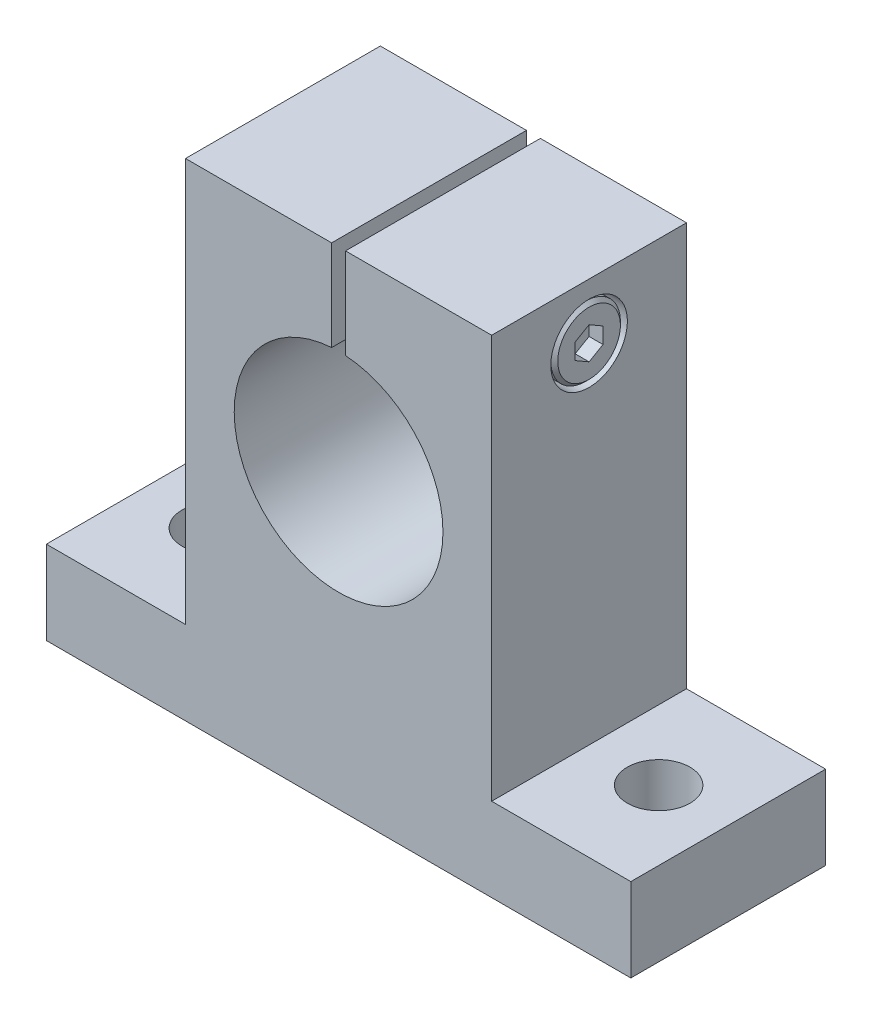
ISO-10303-21;
HEADER;
FILE_DESCRIPTION(('STEP AP214'),'2;1');
FILE_NAME('part.step','',(''),(''),'','','');
FILE_SCHEMA(('AUTOMOTIVE_DESIGN { 1 0 10303 214 1 1 1 1 }'));
ENDSEC;
DATA;
#1=APPLICATION_CONTEXT('core data for automotive mechanical design processes');
#2=APPLICATION_PROTOCOL_DEFINITION('international standard','automotive_design',2000,#1);
#3=PRODUCT_CONTEXT('',#1,'mechanical');
#4=PRODUCT('Part','Part','',(#3));
#5=PRODUCT_RELATED_PRODUCT_CATEGORY('part','',(#4));
#6=PRODUCT_DEFINITION_FORMATION('','',#4);
#7=PRODUCT_DEFINITION_CONTEXT('part definition',#1,'design');
#8=PRODUCT_DEFINITION('design','',#6,#7);
#9=PRODUCT_DEFINITION_SHAPE('','',#8);
#10=(LENGTH_UNIT() NAMED_UNIT(*) SI_UNIT(.MILLI.,.METRE.));
#11=(NAMED_UNIT(*) PLANE_ANGLE_UNIT() SI_UNIT($,.RADIAN.));
#12=(NAMED_UNIT(*) SI_UNIT($,.STERADIAN.) SOLID_ANGLE_UNIT());
#13=UNCERTAINTY_MEASURE_WITH_UNIT(LENGTH_MEASURE(1.E-05),#10,'distance_accuracy_value','');
#14=(GEOMETRIC_REPRESENTATION_CONTEXT(3) GLOBAL_UNCERTAINTY_ASSIGNED_CONTEXT((#13)) GLOBAL_UNIT_ASSIGNED_CONTEXT((#10,
#11,#12)) REPRESENTATION_CONTEXT('',''));
#15=CARTESIAN_POINT('',(0.,0.,0.));
#16=DIRECTION('',(0.,0.,1.));
#17=DIRECTION('',(1.,0.,0.));
#18=AXIS2_PLACEMENT_3D('',#15,#16,#17);
#19=CARTESIAN_POINT('',(0.,0.,-28.));
#20=DIRECTION('',(0.,0.,1.));
#21=DIRECTION('',(1.,0.,0.));
#22=AXIS2_PLACEMENT_3D('',#19,#20,#21);
#23=PLANE('',#22);
#24=DIRECTION('',(0.,1.,0.));
#25=VECTOR('',#24,1.);
#26=CARTESIAN_POINT('',(1.,0.,-28.));
#27=LINE('',#26,#25);
#28=CARTESIAN_POINT('',(1.,14.9666295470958,-28.));
#29=VERTEX_POINT('',#28);
#30=CARTESIAN_POINT('',(1.,28.,-28.));
#31=VERTEX_POINT('',#30);
#32=EDGE_CURVE('E237',#29,#31,#27,.T.);
#33=ORIENTED_EDGE('',*,*,#32,.T.);
#34=DIRECTION('',(-1.,0.,0.));
#35=VECTOR('',#34,1.);
#36=CARTESIAN_POINT('',(22.,28.,-28.));
#37=LINE('',#36,#35);
#38=CARTESIAN_POINT('',(22.,28.,-28.));
#39=VERTEX_POINT('',#38);
#40=EDGE_CURVE('E280',#39,#31,#37,.T.);
#41=ORIENTED_EDGE('',*,*,#40,.F.);
#42=DIRECTION('',(0.,1.,0.));
#43=VECTOR('',#42,1.);
#44=CARTESIAN_POINT('',(22.,-30.,-28.));
#45=LINE('',#44,#43);
#46=CARTESIAN_POINT('',(22.,-30.,-28.));
#47=VERTEX_POINT('',#46);
#48=EDGE_CURVE('E422',#47,#39,#45,.T.);
#49=ORIENTED_EDGE('',*,*,#48,.F.);
#50=DIRECTION('',(-1.,0.,0.));
#51=VECTOR('',#50,1.);
#52=CARTESIAN_POINT('',(42.,-30.,-28.));
#53=LINE('',#52,#51);
#54=CARTESIAN_POINT('',(42.,-30.,-28.));
#55=VERTEX_POINT('',#54);
#56=EDGE_CURVE('E481',#55,#47,#53,.T.);
#57=ORIENTED_EDGE('',*,*,#56,.F.);
#58=DIRECTION('',(0.,1.,0.));
#59=VECTOR('',#58,1.);
#60=CARTESIAN_POINT('',(42.,-42.,-28.));
#61=LINE('',#60,#59);
#62=CARTESIAN_POINT('',(42.,-42.,-28.));
#63=VERTEX_POINT('',#62);
#64=EDGE_CURVE('E473',#63,#55,#61,.T.);
#65=ORIENTED_EDGE('',*,*,#64,.F.);
#66=DIRECTION('',(1.,0.,0.));
#67=VECTOR('',#66,1.);
#68=CARTESIAN_POINT('',(-42.,-42.,-28.));
#69=LINE('',#68,#67);
#70=CARTESIAN_POINT('',(-42.,-42.,-28.));
#71=VERTEX_POINT('',#70);
#72=EDGE_CURVE('E10',#71,#63,#69,.T.);
#73=ORIENTED_EDGE('',*,*,#72,.F.);
#74=DIRECTION('',(0.,-1.,0.));
#75=VECTOR('',#74,1.);
#76=CARTESIAN_POINT('',(-42.,-30.,-28.));
#77=LINE('',#76,#75);
#78=CARTESIAN_POINT('',(-42.,-30.,-28.));
#79=VERTEX_POINT('',#78);
#80=EDGE_CURVE('E43',#79,#71,#77,.T.);
#81=ORIENTED_EDGE('',*,*,#80,.F.);
#82=DIRECTION('',(-1.,0.,0.));
#83=VECTOR('',#82,1.);
#84=CARTESIAN_POINT('',(-22.,-30.,-28.));
#85=LINE('',#84,#83);
#86=CARTESIAN_POINT('',(-22.,-30.,-28.));
#87=VERTEX_POINT('',#86);
#88=EDGE_CURVE('E373',#87,#79,#85,.T.);
#89=ORIENTED_EDGE('',*,*,#88,.F.);
#90=DIRECTION('',(0.,-1.,0.));
#91=VECTOR('',#90,1.);
#92=CARTESIAN_POINT('',(-22.,28.,-28.));
#93=LINE('',#92,#91);
#94=CARTESIAN_POINT('',(-22.,28.,-28.));
#95=VERTEX_POINT('',#94);
#96=EDGE_CURVE('E283',#95,#87,#93,.T.);
#97=ORIENTED_EDGE('',*,*,#96,.F.);
#98=DIRECTION('',(-1.,0.,0.));
#99=VECTOR('',#98,1.);
#100=CARTESIAN_POINT('',(22.,28.,-28.));
#101=LINE('',#100,#99);
#102=CARTESIAN_POINT('',(-1.,28.,-28.));
#103=VERTEX_POINT('',#102);
#104=EDGE_CURVE('E231',#103,#95,#101,.T.);
#105=ORIENTED_EDGE('',*,*,#104,.F.);
#106=DIRECTION('',(0.,-1.,0.));
#107=VECTOR('',#106,1.);
#108=CARTESIAN_POINT('',(-1.,14.,-28.));
#109=LINE('',#108,#107);
#110=CARTESIAN_POINT('',(-1.,14.9666295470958,-28.));
#111=VERTEX_POINT('',#110);
#112=EDGE_CURVE('E225',#103,#111,#109,.T.);
#113=ORIENTED_EDGE('',*,*,#112,.T.);
#114=CARTESIAN_POINT('',(0.,0.,-28.));
#115=DIRECTION('',(0.,0.,1.));
#116=DIRECTION('',(1.,0.,0.));
#117=AXIS2_PLACEMENT_3D('',#114,#115,#116);
#118=CIRCLE('',#117,15.);
#119=EDGE_CURVE('E229',#111,#29,#118,.T.);
#120=ORIENTED_EDGE('',*,*,#119,.T.);
#121=EDGE_LOOP('',(#33,#41,#49,#57,#65,#73,#81,#89,#97,#105,#113,#120));
#122=FACE_BOUND('',#121,.T.);
#123=ADVANCED_FACE('F16',(#122),#23,.F.);
#124=CARTESIAN_POINT('',(-42.,-42.,0.));
#125=DIRECTION('',(0.,-1.,0.));
#126=DIRECTION('',(0.,0.,-1.));
#127=AXIS2_PLACEMENT_3D('',#124,#125,#126);
#128=PLANE('',#127);
#129=CARTESIAN_POINT('',(32.,-42.,-14.));
#130=DIRECTION('',(0.,1.,0.));
#131=DIRECTION('',(0.,0.,-1.));
#132=AXIS2_PLACEMENT_3D('',#129,#130,#131);
#133=CIRCLE('',#132,4.5);
#134=CARTESIAN_POINT('',(32.,-42.,-9.5));
#135=VERTEX_POINT('',#134);
#136=EDGE_CURVE('E292',#135,#135,#133,.T.);
#137=ORIENTED_EDGE('',*,*,#136,.T.);
#138=EDGE_LOOP('',(#137));
#139=FACE_BOUND('',#138,.T.);
#140=CARTESIAN_POINT('',(-32.,-42.,-14.));
#141=DIRECTION('',(0.,1.,0.));
#142=DIRECTION('',(0.,0.,-1.));
#143=AXIS2_PLACEMENT_3D('',#140,#141,#142);
#144=CIRCLE('',#143,4.5);
#145=CARTESIAN_POINT('',(-32.,-42.,-9.5));
#146=VERTEX_POINT('',#145);
#147=EDGE_CURVE('E267',#146,#146,#144,.T.);
#148=ORIENTED_EDGE('',*,*,#147,.T.);
#149=EDGE_LOOP('',(#148));
#150=FACE_BOUND('',#149,.T.);
#151=ORIENTED_EDGE('',*,*,#72,.T.);
#152=DIRECTION('',(0.,0.,-1.));
#153=VECTOR('',#152,1.);
#154=CARTESIAN_POINT('',(42.,-42.,0.));
#155=LINE('',#154,#153);
#156=CARTESIAN_POINT('',(42.,-42.,0.));
#157=VERTEX_POINT('',#156);
#158=EDGE_CURVE('E477',#157,#63,#155,.T.);
#159=ORIENTED_EDGE('',*,*,#158,.F.);
#160=DIRECTION('',(1.,0.,0.));
#161=VECTOR('',#160,1.);
#162=CARTESIAN_POINT('',(-42.,-42.,0.));
#163=LINE('',#162,#161);
#164=CARTESIAN_POINT('',(-42.,-42.,0.));
#165=VERTEX_POINT('',#164);
#166=EDGE_CURVE('E353',#165,#157,#163,.T.);
#167=ORIENTED_EDGE('',*,*,#166,.F.);
#168=DIRECTION('',(0.,0.,-1.));
#169=VECTOR('',#168,1.);
#170=CARTESIAN_POINT('',(-42.,-42.,0.));
#171=LINE('',#170,#169);
#172=EDGE_CURVE('E25',#165,#71,#171,.T.);
#173=ORIENTED_EDGE('',*,*,#172,.T.);
#174=EDGE_LOOP('',(#151,#159,#167,#173));
#175=FACE_BOUND('',#174,.T.);
#176=ADVANCED_FACE('F513',(#139,#150,#175),#128,.T.);
#177=CARTESIAN_POINT('',(-42.,-30.,0.));
#178=DIRECTION('',(-1.,0.,0.));
#179=DIRECTION('',(0.,0.,1.));
#180=AXIS2_PLACEMENT_3D('',#177,#178,#179);
#181=PLANE('',#180);
#182=ORIENTED_EDGE('',*,*,#80,.T.);
#183=ORIENTED_EDGE('',*,*,#172,.F.);
#184=DIRECTION('',(0.,-1.,0.));
#185=VECTOR('',#184,1.);
#186=CARTESIAN_POINT('',(-42.,-30.,0.));
#187=LINE('',#186,#185);
#188=CARTESIAN_POINT('',(-42.,-30.,0.));
#189=VERTEX_POINT('',#188);
#190=EDGE_CURVE('E303',#189,#165,#187,.T.);
#191=ORIENTED_EDGE('',*,*,#190,.F.);
#192=DIRECTION('',(0.,0.,-1.));
#193=VECTOR('',#192,1.);
#194=CARTESIAN_POINT('',(-42.,-30.,0.));
#195=LINE('',#194,#193);
#196=EDGE_CURVE('E19',#189,#79,#195,.T.);
#197=ORIENTED_EDGE('',*,*,#196,.T.);
#198=EDGE_LOOP('',(#182,#183,#191,#197));
#199=FACE_BOUND('',#198,.T.);
#200=ADVANCED_FACE('F516',(#199),#181,.T.);
#201=CARTESIAN_POINT('',(-22.,-30.,0.));
#202=DIRECTION('',(0.,1.,0.));
#203=DIRECTION('',(1.,0.,0.));
#204=AXIS2_PLACEMENT_3D('',#201,#202,#203);
#205=PLANE('',#204);
#206=CARTESIAN_POINT('',(-32.,-30.,-14.));
#207=DIRECTION('',(0.,-1.,0.));
#208=DIRECTION('',(0.,0.,-1.));
#209=AXIS2_PLACEMENT_3D('',#206,#207,#208);
#210=CIRCLE('',#209,4.5);
#211=CARTESIAN_POINT('',(-32.,-30.,-9.5));
#212=VERTEX_POINT('',#211);
#213=EDGE_CURVE('E295',#212,#212,#210,.T.);
#214=ORIENTED_EDGE('',*,*,#213,.T.);
#215=EDGE_LOOP('',(#214));
#216=FACE_BOUND('',#215,.T.);
#217=ORIENTED_EDGE('',*,*,#88,.T.);
#218=ORIENTED_EDGE('',*,*,#196,.F.);
#219=DIRECTION('',(-1.,0.,0.));
#220=VECTOR('',#219,1.);
#221=CARTESIAN_POINT('',(-22.,-30.,0.));
#222=LINE('',#221,#220);
#223=CARTESIAN_POINT('',(-22.,-30.,0.));
#224=VERTEX_POINT('',#223);
#225=EDGE_CURVE('E299',#224,#189,#222,.T.);
#226=ORIENTED_EDGE('',*,*,#225,.F.);
#227=DIRECTION('',(0.,0.,-1.));
#228=VECTOR('',#227,1.);
#229=CARTESIAN_POINT('',(-22.,-30.,0.));
#230=LINE('',#229,#228);
#231=EDGE_CURVE('E377',#224,#87,#230,.T.);
#232=ORIENTED_EDGE('',*,*,#231,.T.);
#233=EDGE_LOOP('',(#217,#218,#226,#232));
#234=FACE_BOUND('',#233,.T.);
#235=ADVANCED_FACE('F520',(#216,#234),#205,.T.);
#236=CARTESIAN_POINT('',(-22.,28.,0.));
#237=DIRECTION('',(-1.,0.,0.));
#238=DIRECTION('',(0.,0.,1.));
#239=AXIS2_PLACEMENT_3D('',#236,#237,#238);
#240=PLANE('',#239);
#241=ORIENTED_EDGE('',*,*,#96,.T.);
#242=ORIENTED_EDGE('',*,*,#231,.F.);
#243=DIRECTION('',(0.,-1.,0.));
#244=VECTOR('',#243,1.);
#245=CARTESIAN_POINT('',(-22.,28.,0.));
#246=LINE('',#245,#244);
#247=CARTESIAN_POINT('',(-22.,28.,0.));
#248=VERTEX_POINT('',#247);
#249=EDGE_CURVE('E304',#248,#224,#246,.T.);
#250=ORIENTED_EDGE('',*,*,#249,.F.);
#251=DIRECTION('',(0.,0.,-1.));
#252=VECTOR('',#251,1.);
#253=CARTESIAN_POINT('',(-22.,28.,0.));
#254=LINE('',#253,#252);
#255=EDGE_CURVE('E469',#248,#95,#254,.T.);
#256=ORIENTED_EDGE('',*,*,#255,.T.);
#257=EDGE_LOOP('',(#241,#242,#250,#256));
#258=FACE_BOUND('',#257,.T.);
#259=ADVANCED_FACE('F523',(#258),#240,.T.);
#260=CARTESIAN_POINT('',(22.,28.,0.));
#261=DIRECTION('',(0.,1.,0.));
#262=DIRECTION('',(1.,0.,0.));
#263=AXIS2_PLACEMENT_3D('',#260,#261,#262);
#264=PLANE('',#263);
#265=DIRECTION('',(0.,0.,1.));
#266=VECTOR('',#265,1.);
#267=CARTESIAN_POINT('',(1.,28.,0.));
#268=LINE('',#267,#266);
#269=CARTESIAN_POINT('',(1.,28.,0.));
#270=VERTEX_POINT('',#269);
#271=EDGE_CURVE('E432',#31,#270,#268,.T.);
#272=ORIENTED_EDGE('',*,*,#271,.T.);
#273=DIRECTION('',(-1.,0.,0.));
#274=VECTOR('',#273,1.);
#275=CARTESIAN_POINT('',(22.,28.,0.));
#276=LINE('',#275,#274);
#277=CARTESIAN_POINT('',(22.,28.,0.));
#278=VERTEX_POINT('',#277);
#279=EDGE_CURVE('E464',#278,#270,#276,.T.);
#280=ORIENTED_EDGE('',*,*,#279,.F.);
#281=DIRECTION('',(0.,0.,-1.));
#282=VECTOR('',#281,1.);
#283=CARTESIAN_POINT('',(22.,28.,0.));
#284=LINE('',#283,#282);
#285=EDGE_CURVE('E284',#278,#39,#284,.T.);
#286=ORIENTED_EDGE('',*,*,#285,.T.);
#287=ORIENTED_EDGE('',*,*,#40,.T.);
#288=EDGE_LOOP('',(#272,#280,#286,#287));
#289=FACE_BOUND('',#288,.T.);
#290=ADVANCED_FACE('F493',(#289),#264,.T.);
#291=CARTESIAN_POINT('',(22.,-30.,0.));
#292=DIRECTION('',(1.,0.,0.));
#293=DIRECTION('',(0.,1.,0.));
#294=AXIS2_PLACEMENT_3D('',#291,#292,#293);
#295=PLANE('',#294);
#296=CARTESIAN_POINT('',(22.,20.,-14.));
#297=DIRECTION('',(-1.,0.,0.));
#298=DIRECTION('',(0.,0.,-1.));
#299=AXIS2_PLACEMENT_3D('',#296,#297,#298);
#300=CIRCLE('',#299,5.5);
#301=CARTESIAN_POINT('',(22.,20.,-8.5));
#302=VERTEX_POINT('',#301);
#303=EDGE_CURVE('E275',#302,#302,#300,.T.);
#304=ORIENTED_EDGE('',*,*,#303,.T.);
#305=EDGE_LOOP('',(#304));
#306=FACE_BOUND('',#305,.T.);
#307=ORIENTED_EDGE('',*,*,#48,.T.);
#308=ORIENTED_EDGE('',*,*,#285,.F.);
#309=DIRECTION('',(0.,1.,0.));
#310=VECTOR('',#309,1.);
#311=CARTESIAN_POINT('',(22.,-30.,0.));
#312=LINE('',#311,#310);
#313=CARTESIAN_POINT('',(22.,-30.,0.));
#314=VERTEX_POINT('',#313);
#315=EDGE_CURVE('E460',#314,#278,#312,.T.);
#316=ORIENTED_EDGE('',*,*,#315,.F.);
#317=DIRECTION('',(0.,0.,-1.));
#318=VECTOR('',#317,1.);
#319=CARTESIAN_POINT('',(22.,-30.,0.));
#320=LINE('',#319,#318);
#321=EDGE_CURVE('E426',#314,#47,#320,.T.);
#322=ORIENTED_EDGE('',*,*,#321,.T.);
#323=EDGE_LOOP('',(#307,#308,#316,#322));
#324=FACE_BOUND('',#323,.T.);
#325=ADVANCED_FACE('F496',(#306,#324),#295,.T.);
#326=CARTESIAN_POINT('',(42.,-30.,0.));
#327=DIRECTION('',(0.,1.,0.));
#328=DIRECTION('',(1.,0.,0.));
#329=AXIS2_PLACEMENT_3D('',#326,#327,#328);
#330=PLANE('',#329);
#331=CARTESIAN_POINT('',(32.,-30.,-14.));
#332=DIRECTION('',(0.,-1.,0.));
#333=DIRECTION('',(0.,0.,-1.));
#334=AXIS2_PLACEMENT_3D('',#331,#332,#333);
#335=CIRCLE('',#334,4.5);
#336=CARTESIAN_POINT('',(32.,-30.,-9.5));
#337=VERTEX_POINT('',#336);
#338=EDGE_CURVE('E268',#337,#337,#335,.T.);
#339=ORIENTED_EDGE('',*,*,#338,.T.);
#340=EDGE_LOOP('',(#339));
#341=FACE_BOUND('',#340,.T.);
#342=ORIENTED_EDGE('',*,*,#56,.T.);
#343=ORIENTED_EDGE('',*,*,#321,.F.);
#344=DIRECTION('',(-1.,0.,0.));
#345=VECTOR('',#344,1.);
#346=CARTESIAN_POINT('',(42.,-30.,0.));
#347=LINE('',#346,#345);
#348=CARTESIAN_POINT('',(42.,-30.,0.));
#349=VERTEX_POINT('',#348);
#350=EDGE_CURVE('E456',#349,#314,#347,.T.);
#351=ORIENTED_EDGE('',*,*,#350,.F.);
#352=DIRECTION('',(0.,0.,-1.));
#353=VECTOR('',#352,1.);
#354=CARTESIAN_POINT('',(42.,-30.,0.));
#355=LINE('',#354,#353);
#356=EDGE_CURVE('E261',#349,#55,#355,.T.);
#357=ORIENTED_EDGE('',*,*,#356,.T.);
#358=EDGE_LOOP('',(#342,#343,#351,#357));
#359=FACE_BOUND('',#358,.T.);
#360=ADVANCED_FACE('F507',(#341,#359),#330,.T.);
#361=CARTESIAN_POINT('',(42.,-42.,0.));
#362=DIRECTION('',(1.,0.,0.));
#363=DIRECTION('',(0.,1.,0.));
#364=AXIS2_PLACEMENT_3D('',#361,#362,#363);
#365=PLANE('',#364);
#366=ORIENTED_EDGE('',*,*,#64,.T.);
#367=ORIENTED_EDGE('',*,*,#356,.F.);
#368=DIRECTION('',(0.,1.,0.));
#369=VECTOR('',#368,1.);
#370=CARTESIAN_POINT('',(42.,-42.,0.));
#371=LINE('',#370,#369);
#372=EDGE_CURVE('E357',#157,#349,#371,.T.);
#373=ORIENTED_EDGE('',*,*,#372,.F.);
#374=ORIENTED_EDGE('',*,*,#158,.T.);
#375=EDGE_LOOP('',(#366,#367,#373,#374));
#376=FACE_BOUND('',#375,.T.);
#377=ADVANCED_FACE('F510',(#376),#365,.T.);
#378=CARTESIAN_POINT('',(22.,28.,0.));
#379=DIRECTION('',(0.,1.,0.));
#380=DIRECTION('',(1.,0.,0.));
#381=AXIS2_PLACEMENT_3D('',#378,#379,#380);
#382=PLANE('',#381);
#383=DIRECTION('',(0.,0.,-1.));
#384=VECTOR('',#383,1.);
#385=CARTESIAN_POINT('',(-1.,28.,0.));
#386=LINE('',#385,#384);
#387=CARTESIAN_POINT('',(-1.,28.,0.));
#388=VERTEX_POINT('',#387);
#389=EDGE_CURVE('E236',#388,#103,#386,.T.);
#390=ORIENTED_EDGE('',*,*,#389,.T.);
#391=ORIENTED_EDGE('',*,*,#104,.T.);
#392=ORIENTED_EDGE('',*,*,#255,.F.);
#393=DIRECTION('',(-1.,0.,0.));
#394=VECTOR('',#393,1.);
#395=CARTESIAN_POINT('',(22.,28.,0.));
#396=LINE('',#395,#394);
#397=EDGE_CURVE('E407',#388,#248,#396,.T.);
#398=ORIENTED_EDGE('',*,*,#397,.F.);
#399=EDGE_LOOP('',(#390,#391,#392,#398));
#400=FACE_BOUND('',#399,.T.);
#401=ADVANCED_FACE('F525',(#400),#382,.T.);
#402=CARTESIAN_POINT('',(0.,0.,0.));
#403=DIRECTION('',(0.,0.,1.));
#404=DIRECTION('',(1.,0.,0.));
#405=AXIS2_PLACEMENT_3D('',#402,#403,#404);
#406=PLANE('',#405);
#407=DIRECTION('',(0.,-1.,0.));
#408=VECTOR('',#407,1.);
#409=CARTESIAN_POINT('',(1.,0.,0.));
#410=LINE('',#409,#408);
#411=CARTESIAN_POINT('',(1.,14.9666295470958,0.));
#412=VERTEX_POINT('',#411);
#413=EDGE_CURVE('E429',#270,#412,#410,.T.);
#414=ORIENTED_EDGE('',*,*,#413,.T.);
#415=CARTESIAN_POINT('',(0.,0.,0.));
#416=DIRECTION('',(0.,0.,-1.));
#417=DIRECTION('',(1.,0.,0.));
#418=AXIS2_PLACEMENT_3D('',#415,#416,#417);
#419=CIRCLE('',#418,15.);
#420=CARTESIAN_POINT('',(-1.,14.9666295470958,0.));
#421=VERTEX_POINT('',#420);
#422=EDGE_CURVE('E248',#412,#421,#419,.T.);
#423=ORIENTED_EDGE('',*,*,#422,.T.);
#424=DIRECTION('',(0.,1.,0.));
#425=VECTOR('',#424,1.);
#426=CARTESIAN_POINT('',(-1.,14.,0.));
#427=LINE('',#426,#425);
#428=EDGE_CURVE('E243',#421,#388,#427,.T.);
#429=ORIENTED_EDGE('',*,*,#428,.T.);
#430=ORIENTED_EDGE('',*,*,#397,.T.);
#431=ORIENTED_EDGE('',*,*,#249,.T.);
#432=ORIENTED_EDGE('',*,*,#225,.T.);
#433=ORIENTED_EDGE('',*,*,#190,.T.);
#434=ORIENTED_EDGE('',*,*,#166,.T.);
#435=ORIENTED_EDGE('',*,*,#372,.T.);
#436=ORIENTED_EDGE('',*,*,#350,.T.);
#437=ORIENTED_EDGE('',*,*,#315,.T.);
#438=ORIENTED_EDGE('',*,*,#279,.T.);
#439=EDGE_LOOP('',(#414,#423,#429,#430,#431,#432,#433,#434,#435,#436,#437,#438));
#440=FACE_BOUND('',#439,.T.);
#441=ADVANCED_FACE('F503',(#440),#406,.T.);
#442=CARTESIAN_POINT('',(-1.,28.,0.));
#443=DIRECTION('',(-1.,0.,0.));
#444=DIRECTION('',(0.,0.,1.));
#445=AXIS2_PLACEMENT_3D('',#442,#443,#444);
#446=PLANE('',#445);
#447=CARTESIAN_POINT('',(-1.,20.,-14.));
#448=DIRECTION('',(-1.,0.,0.));
#449=DIRECTION('',(0.,1.,0.));
#450=AXIS2_PLACEMENT_3D('',#447,#448,#449);
#451=CIRCLE('',#450,3.);
#452=CARTESIAN_POINT('',(-1.,17.,-14.));
#453=VERTEX_POINT('',#452);
#454=EDGE_CURVE('E291',#453,#453,#451,.T.);
#455=ORIENTED_EDGE('',*,*,#454,.T.);
#456=EDGE_LOOP('',(#455));
#457=FACE_BOUND('',#456,.T.);
#458=DIRECTION('',(0.,0.,1.));
#459=VECTOR('',#458,1.);
#460=CARTESIAN_POINT('',(-1.,14.9666295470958,-14.));
#461=LINE('',#460,#459);
#462=EDGE_CURVE('E240',#111,#421,#461,.T.);
#463=ORIENTED_EDGE('',*,*,#462,.F.);
#464=ORIENTED_EDGE('',*,*,#112,.F.);
#465=ORIENTED_EDGE('',*,*,#389,.F.);
#466=ORIENTED_EDGE('',*,*,#428,.F.);
#467=EDGE_LOOP('',(#463,#464,#465,#466));
#468=FACE_BOUND('',#467,.T.);
#469=ADVANCED_FACE('F241',(#457,#468),#446,.F.);
#470=CARTESIAN_POINT('',(1.,0.,0.));
#471=DIRECTION('',(1.,0.,0.));
#472=DIRECTION('',(0.,1.,0.));
#473=AXIS2_PLACEMENT_3D('',#470,#471,#472);
#474=PLANE('',#473);
#475=CARTESIAN_POINT('',(1.,20.,-14.));
#476=DIRECTION('',(1.,0.,0.));
#477=DIRECTION('',(0.,1.,0.));
#478=AXIS2_PLACEMENT_3D('',#475,#476,#477);
#479=CIRCLE('',#478,3.);
#480=CARTESIAN_POINT('',(1.,17.,-14.));
#481=VERTEX_POINT('',#480);
#482=EDGE_CURVE('E262',#481,#481,#479,.T.);
#483=ORIENTED_EDGE('',*,*,#482,.T.);
#484=EDGE_LOOP('',(#483));
#485=FACE_BOUND('',#484,.T.);
#486=DIRECTION('',(0.,0.,-1.));
#487=VECTOR('',#486,1.);
#488=CARTESIAN_POINT('',(1.,14.9666295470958,-14.));
#489=LINE('',#488,#487);
#490=EDGE_CURVE('E253',#412,#29,#489,.T.);
#491=ORIENTED_EDGE('',*,*,#490,.F.);
#492=ORIENTED_EDGE('',*,*,#413,.F.);
#493=ORIENTED_EDGE('',*,*,#271,.F.);
#494=ORIENTED_EDGE('',*,*,#32,.F.);
#495=EDGE_LOOP('',(#491,#492,#493,#494));
#496=FACE_BOUND('',#495,.T.);
#497=ADVANCED_FACE('F501',(#485,#496),#474,.F.);
#498=CARTESIAN_POINT('',(18.,0.,0.));
#499=DIRECTION('',(1.,0.,0.));
#500=DIRECTION('',(0.,1.,0.));
#501=AXIS2_PLACEMENT_3D('',#498,#499,#500);
#502=PLANE('',#501);
#503=CARTESIAN_POINT('',(18.,20.,-14.));
#504=DIRECTION('',(-1.,0.,0.));
#505=DIRECTION('',(0.,1.,0.));
#506=AXIS2_PLACEMENT_3D('',#503,#504,#505);
#507=CIRCLE('',#506,5.);
#508=CARTESIAN_POINT('',(18.,15.,-14.));
#509=VERTEX_POINT('',#508);
#510=EDGE_CURVE('E334',#509,#509,#507,.T.);
#511=ORIENTED_EDGE('',*,*,#510,.T.);
#512=EDGE_LOOP('',(#511));
#513=FACE_BOUND('',#512,.T.);
#514=CARTESIAN_POINT('',(18.,20.,-14.));
#515=DIRECTION('',(1.,0.,0.));
#516=DIRECTION('',(0.,0.,-1.));
#517=AXIS2_PLACEMENT_3D('',#514,#515,#516);
#518=CIRCLE('',#517,5.5);
#519=CARTESIAN_POINT('',(18.,20.,-8.5));
#520=VERTEX_POINT('',#519);
#521=EDGE_CURVE('E287',#520,#520,#518,.T.);
#522=ORIENTED_EDGE('',*,*,#521,.T.);
#523=EDGE_LOOP('',(#522));
#524=FACE_BOUND('',#523,.T.);
#525=ADVANCED_FACE('F598',(#513,#524),#502,.T.);
#526=CARTESIAN_POINT('',(22.,22.25,-14.));
#527=DIRECTION('',(1.,0.,0.));
#528=DIRECTION('',(0.,1.,0.));
#529=AXIS2_PLACEMENT_3D('',#526,#527,#528);
#530=PLANE('',#529);
#531=DIRECTION('',(0.,0.5,0.866025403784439));
#532=VECTOR('',#531,1.);
#533=CARTESIAN_POINT('',(22.,18.8378743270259,-12.0128607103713));
#534=LINE('',#533,#532);
#535=CARTESIAN_POINT('',(22.,17.6905989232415,-14.));
#536=VERTEX_POINT('',#535);
#537=CARTESIAN_POINT('',(22.,18.8452994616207,-12.));
#538=VERTEX_POINT('',#537);
#539=EDGE_CURVE('E352',#536,#538,#534,.T.);
#540=ORIENTED_EDGE('',*,*,#539,.T.);
#541=DIRECTION('',(0.,1.,0.));
#542=VECTOR('',#541,1.);
#543=CARTESIAN_POINT('',(22.,21.7023502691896,-12.));
#544=LINE('',#543,#542);
#545=CARTESIAN_POINT('',(22.,21.1547005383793,-12.));
#546=VERTEX_POINT('',#545);
#547=EDGE_CURVE('E421',#538,#546,#544,.T.);
#548=ORIENTED_EDGE('',*,*,#547,.T.);
#549=DIRECTION('',(0.,0.5,-0.866025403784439));
#550=VECTOR('',#549,1.);
#551=CARTESIAN_POINT('',(22.,22.3019759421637,-13.9871392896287));
#552=LINE('',#551,#550);
#553=CARTESIAN_POINT('',(22.,22.3094010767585,-14.));
#554=VERTEX_POINT('',#553);
#555=EDGE_CURVE('E411',#546,#554,#552,.T.);
#556=ORIENTED_EDGE('',*,*,#555,.T.);
#557=DIRECTION('',(0.,-0.5,-0.866025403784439));
#558=VECTOR('',#557,1.);
#559=CARTESIAN_POINT('',(22.,21.7246256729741,-15.0128607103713));
#560=LINE('',#559,#558);
#561=CARTESIAN_POINT('',(22.,21.1547005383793,-16.));
#562=VERTEX_POINT('',#561);
#563=EDGE_CURVE('E319',#554,#562,#560,.T.);
#564=ORIENTED_EDGE('',*,*,#563,.T.);
#565=DIRECTION('',(0.,-1.,0.));
#566=VECTOR('',#565,1.);
#567=CARTESIAN_POINT('',(22.,20.5476497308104,-16.));
#568=LINE('',#567,#566);
#569=CARTESIAN_POINT('',(22.,18.8452994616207,-16.));
#570=VERTEX_POINT('',#569);
#571=EDGE_CURVE('E385',#562,#570,#568,.T.);
#572=ORIENTED_EDGE('',*,*,#571,.T.);
#573=DIRECTION('',(0.,-0.5,0.866025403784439));
#574=VECTOR('',#573,1.);
#575=CARTESIAN_POINT('',(22.,18.2605240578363,-14.9871392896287));
#576=LINE('',#575,#574);
#577=EDGE_CURVE('E369',#570,#536,#576,.T.);
#578=ORIENTED_EDGE('',*,*,#577,.T.);
#579=EDGE_LOOP('',(#540,#548,#556,#564,#572,#578));
#580=FACE_BOUND('',#579,.T.);
#581=CARTESIAN_POINT('',(22.,20.,-14.));
#582=DIRECTION('',(-1.,0.,0.));
#583=DIRECTION('',(0.,1.,0.));
#584=AXIS2_PLACEMENT_3D('',#581,#582,#583);
#585=CIRCLE('',#584,4.5);
#586=CARTESIAN_POINT('',(22.,15.5,-14.));
#587=VERTEX_POINT('',#586);
#588=EDGE_CURVE('E341',#587,#587,#585,.T.);
#589=ORIENTED_EDGE('',*,*,#588,.F.);
#590=EDGE_LOOP('',(#589));
#591=FACE_BOUND('',#590,.T.);
#592=ADVANCED_FACE('F594',(#580,#591),#530,.T.);
#593=CARTESIAN_POINT('',(20.,0.,0.));
#594=DIRECTION('',(1.,0.,0.));
#595=DIRECTION('',(0.,1.,0.));
#596=AXIS2_PLACEMENT_3D('',#593,#594,#595);
#597=PLANE('',#596);
#598=DIRECTION('',(0.,-0.5,-0.866025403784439));
#599=VECTOR('',#598,1.);
#600=CARTESIAN_POINT('',(20.,18.8452994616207,-12.));
#601=LINE('',#600,#599);
#602=CARTESIAN_POINT('',(20.,18.8452994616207,-12.));
#603=VERTEX_POINT('',#602);
#604=CARTESIAN_POINT('',(20.,17.6905989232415,-14.));
#605=VERTEX_POINT('',#604);
#606=EDGE_CURVE('E344',#603,#605,#601,.T.);
#607=ORIENTED_EDGE('',*,*,#606,.T.);
#608=DIRECTION('',(0.,0.5,-0.866025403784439));
#609=VECTOR('',#608,1.);
#610=CARTESIAN_POINT('',(20.,17.6905989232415,-14.));
#611=LINE('',#610,#609);
#612=CARTESIAN_POINT('',(20.,18.8452994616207,-16.));
#613=VERTEX_POINT('',#612);
#614=EDGE_CURVE('E365',#605,#613,#611,.T.);
#615=ORIENTED_EDGE('',*,*,#614,.T.);
#616=DIRECTION('',(0.,1.,0.));
#617=VECTOR('',#616,1.);
#618=CARTESIAN_POINT('',(20.,18.8452994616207,-16.));
#619=LINE('',#618,#617);
#620=CARTESIAN_POINT('',(20.,21.1547005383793,-16.));
#621=VERTEX_POINT('',#620);
#622=EDGE_CURVE('E381',#613,#621,#619,.T.);
#623=ORIENTED_EDGE('',*,*,#622,.T.);
#624=DIRECTION('',(0.,0.5,0.866025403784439));
#625=VECTOR('',#624,1.);
#626=CARTESIAN_POINT('',(20.,21.1547005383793,-16.));
#627=LINE('',#626,#625);
#628=CARTESIAN_POINT('',(20.,22.3094010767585,-14.));
#629=VERTEX_POINT('',#628);
#630=EDGE_CURVE('E323',#621,#629,#627,.T.);
#631=ORIENTED_EDGE('',*,*,#630,.T.);
#632=DIRECTION('',(0.,-0.5,0.866025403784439));
#633=VECTOR('',#632,1.);
#634=CARTESIAN_POINT('',(20.,22.3094010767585,-14.));
#635=LINE('',#634,#633);
#636=CARTESIAN_POINT('',(20.,21.1547005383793,-12.));
#637=VERTEX_POINT('',#636);
#638=EDGE_CURVE('E399',#629,#637,#635,.T.);
#639=ORIENTED_EDGE('',*,*,#638,.T.);
#640=DIRECTION('',(0.,-1.,0.));
#641=VECTOR('',#640,1.);
#642=CARTESIAN_POINT('',(20.,21.1547005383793,-12.));
#643=LINE('',#642,#641);
#644=EDGE_CURVE('E418',#637,#603,#643,.T.);
#645=ORIENTED_EDGE('',*,*,#644,.T.);
#646=EDGE_LOOP('',(#607,#615,#623,#631,#639,#645));
#647=FACE_BOUND('',#646,.T.);
#648=ADVANCED_FACE('F597',(#647),#597,.T.);
#649=CARTESIAN_POINT('',(22.,21.1547005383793,-12.));
#650=DIRECTION('',(0.,0.,1.));
#651=DIRECTION('',(1.,0.,0.));
#652=AXIS2_PLACEMENT_3D('',#649,#650,#651);
#653=PLANE('',#652);
#654=ORIENTED_EDGE('',*,*,#644,.F.);
#655=DIRECTION('',(-1.,0.,0.));
#656=VECTOR('',#655,1.);
#657=CARTESIAN_POINT('',(22.,21.1547005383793,-12.));
#658=LINE('',#657,#656);
#659=EDGE_CURVE('E414',#546,#637,#658,.T.);
#660=ORIENTED_EDGE('',*,*,#659,.F.);
#661=ORIENTED_EDGE('',*,*,#547,.F.);
#662=DIRECTION('',(-1.,0.,0.));
#663=VECTOR('',#662,1.);
#664=CARTESIAN_POINT('',(22.,18.8452994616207,-12.));
#665=LINE('',#664,#663);
#666=EDGE_CURVE('E348',#538,#603,#665,.T.);
#667=ORIENTED_EDGE('',*,*,#666,.T.);
#668=EDGE_LOOP('',(#654,#660,#661,#667));
#669=FACE_BOUND('',#668,.T.);
#670=ADVANCED_FACE('F602',(#669),#653,.F.);
#671=CARTESIAN_POINT('',(22.,22.3094010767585,-14.));
#672=DIRECTION('',(0.,0.866025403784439,0.5));
#673=DIRECTION('',(1.,0.,0.));
#674=AXIS2_PLACEMENT_3D('',#671,#672,#673);
#675=PLANE('',#674);
#676=ORIENTED_EDGE('',*,*,#638,.F.);
#677=DIRECTION('',(-1.,0.,0.));
#678=VECTOR('',#677,1.);
#679=CARTESIAN_POINT('',(22.,22.3094010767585,-14.));
#680=LINE('',#679,#678);
#681=EDGE_CURVE('E322',#554,#629,#680,.T.);
#682=ORIENTED_EDGE('',*,*,#681,.F.);
#683=ORIENTED_EDGE('',*,*,#555,.F.);
#684=ORIENTED_EDGE('',*,*,#659,.T.);
#685=EDGE_LOOP('',(#676,#682,#683,#684));
#686=FACE_BOUND('',#685,.T.);
#687=ADVANCED_FACE('F612',(#686),#675,.F.);
#688=CARTESIAN_POINT('',(22.,21.1547005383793,-16.));
#689=DIRECTION('',(0.,0.866025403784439,-0.5));
#690=DIRECTION('',(-1.,0.,0.));
#691=AXIS2_PLACEMENT_3D('',#688,#689,#690);
#692=PLANE('',#691);
#693=ORIENTED_EDGE('',*,*,#630,.F.);
#694=DIRECTION('',(-1.,0.,0.));
#695=VECTOR('',#694,1.);
#696=CARTESIAN_POINT('',(22.,21.1547005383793,-16.));
#697=LINE('',#696,#695);
#698=EDGE_CURVE('E388',#562,#621,#697,.T.);
#699=ORIENTED_EDGE('',*,*,#698,.F.);
#700=ORIENTED_EDGE('',*,*,#563,.F.);
#701=ORIENTED_EDGE('',*,*,#681,.T.);
#702=EDGE_LOOP('',(#693,#699,#700,#701));
#703=FACE_BOUND('',#702,.T.);
#704=ADVANCED_FACE('F592',(#703),#692,.F.);
#705=CARTESIAN_POINT('',(22.,18.8452994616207,-16.));
#706=DIRECTION('',(0.,0.,-1.));
#707=DIRECTION('',(0.,-1.,0.));
#708=AXIS2_PLACEMENT_3D('',#705,#706,#707);
#709=PLANE('',#708);
#710=ORIENTED_EDGE('',*,*,#622,.F.);
#711=DIRECTION('',(-1.,0.,0.));
#712=VECTOR('',#711,1.);
#713=CARTESIAN_POINT('',(22.,18.8452994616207,-16.));
#714=LINE('',#713,#712);
#715=EDGE_CURVE('E372',#570,#613,#714,.T.);
#716=ORIENTED_EDGE('',*,*,#715,.F.);
#717=ORIENTED_EDGE('',*,*,#571,.F.);
#718=ORIENTED_EDGE('',*,*,#698,.T.);
#719=EDGE_LOOP('',(#710,#716,#717,#718));
#720=FACE_BOUND('',#719,.T.);
#721=ADVANCED_FACE('F589',(#720),#709,.F.);
#722=CARTESIAN_POINT('',(22.,17.6905989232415,-14.));
#723=DIRECTION('',(0.,-0.866025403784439,-0.5));
#724=DIRECTION('',(0.,0.5,-0.866025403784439));
#725=AXIS2_PLACEMENT_3D('',#722,#723,#724);
#726=PLANE('',#725);
#727=ORIENTED_EDGE('',*,*,#614,.F.);
#728=DIRECTION('',(-1.,0.,0.));
#729=VECTOR('',#728,1.);
#730=CARTESIAN_POINT('',(22.,17.6905989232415,-14.));
#731=LINE('',#730,#729);
#732=EDGE_CURVE('E361',#536,#605,#731,.T.);
#733=ORIENTED_EDGE('',*,*,#732,.F.);
#734=ORIENTED_EDGE('',*,*,#577,.F.);
#735=ORIENTED_EDGE('',*,*,#715,.T.);
#736=EDGE_LOOP('',(#727,#733,#734,#735));
#737=FACE_BOUND('',#736,.T.);
#738=ADVANCED_FACE('F574',(#737),#726,.F.);
#739=CARTESIAN_POINT('',(22.,18.8452994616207,-12.));
#740=DIRECTION('',(0.,-0.866025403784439,0.5));
#741=DIRECTION('',(-1.,0.,0.));
#742=AXIS2_PLACEMENT_3D('',#739,#740,#741);
#743=PLANE('',#742);
#744=ORIENTED_EDGE('',*,*,#606,.F.);
#745=ORIENTED_EDGE('',*,*,#666,.F.);
#746=ORIENTED_EDGE('',*,*,#539,.F.);
#747=ORIENTED_EDGE('',*,*,#732,.T.);
#748=EDGE_LOOP('',(#744,#745,#746,#747));
#749=FACE_BOUND('',#748,.T.);
#750=ADVANCED_FACE('F576',(#749),#743,.F.);
#751=CARTESIAN_POINT('',(21.75,20.,-14.));
#752=DIRECTION('',(-1.,0.,0.));
#753=DIRECTION('',(0.,1.,0.));
#754=AXIS2_PLACEMENT_3D('',#751,#752,#753);
#755=CONICAL_SURFACE('',#754,4.75,0.785398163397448);
#756=CARTESIAN_POINT('',(21.5,20.,-14.));
#757=DIRECTION('',(-1.,0.,0.));
#758=DIRECTION('',(0.,1.,0.));
#759=AXIS2_PLACEMENT_3D('',#756,#757,#758);
#760=CIRCLE('',#759,5.);
#761=CARTESIAN_POINT('',(21.5,15.,-14.));
#762=VERTEX_POINT('',#761);
#763=EDGE_CURVE('E278',#762,#762,#760,.T.);
#764=ORIENTED_EDGE('',*,*,#763,.F.);
#765=DIRECTION('',(0.707106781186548,0.707106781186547,0.));
#766=VECTOR('',#765,1.);
#767=CARTESIAN_POINT('',(21.75,15.25,-14.));
#768=LINE('',#767,#766);
#769=EDGE_CURVE('E337',#762,#587,#768,.T.);
#770=ORIENTED_EDGE('',*,*,#769,.T.);
#771=ORIENTED_EDGE('',*,*,#588,.T.);
#772=ORIENTED_EDGE('',*,*,#769,.F.);
#773=EDGE_LOOP('',(#764,#770,#771,#772));
#774=FACE_BOUND('',#773,.T.);
#775=ADVANCED_FACE('F578',(#774),#755,.T.);
#776=CARTESIAN_POINT('',(19.75,20.,-14.));
#777=DIRECTION('',(1.,0.,0.));
#778=DIRECTION('',(0.,1.,0.));
#779=AXIS2_PLACEMENT_3D('',#776,#777,#778);
#780=CYLINDRICAL_SURFACE('',#779,5.);
#781=ORIENTED_EDGE('',*,*,#763,.T.);
#782=DIRECTION('',(-1.,0.,0.));
#783=VECTOR('',#782,1.);
#784=CARTESIAN_POINT('',(19.75,15.,-14.));
#785=LINE('',#784,#783);
#786=EDGE_CURVE('E330',#762,#509,#785,.T.);
#787=ORIENTED_EDGE('',*,*,#786,.T.);
#788=ORIENTED_EDGE('',*,*,#510,.F.);
#789=ORIENTED_EDGE('',*,*,#786,.F.);
#790=EDGE_LOOP('',(#781,#787,#788,#789));
#791=FACE_BOUND('',#790,.T.);
#792=ADVANCED_FACE('F583',(#791),#780,.T.);
#793=CARTESIAN_POINT('',(22.,20.,-14.));
#794=DIRECTION('',(1.,0.,0.));
#795=DIRECTION('',(0.,0.,-1.));
#796=AXIS2_PLACEMENT_3D('',#793,#794,#795);
#797=CYLINDRICAL_SURFACE('',#796,5.5);
#798=ORIENTED_EDGE('',*,*,#521,.F.);
#799=DIRECTION('',(1.,0.,0.));
#800=VECTOR('',#799,1.);
#801=CARTESIAN_POINT('',(22.,20.,-8.5));
#802=LINE('',#801,#800);
#803=EDGE_CURVE('E279',#520,#302,#802,.T.);
#804=ORIENTED_EDGE('',*,*,#803,.T.);
#805=ORIENTED_EDGE('',*,*,#303,.F.);
#806=ORIENTED_EDGE('',*,*,#803,.F.);
#807=EDGE_LOOP('',(#798,#804,#805,#806));
#808=FACE_BOUND('',#807,.T.);
#809=ADVANCED_FACE('F587',(#808),#797,.F.);
#810=CARTESIAN_POINT('',(0.,20.,-14.));
#811=DIRECTION('',(1.,0.,0.));
#812=DIRECTION('',(0.,1.,0.));
#813=AXIS2_PLACEMENT_3D('',#810,#811,#812);
#814=CYLINDRICAL_SURFACE('',#813,3.);
#815=ORIENTED_EDGE('',*,*,#482,.F.);
#816=DIRECTION('',(-1.,0.,0.));
#817=VECTOR('',#816,1.);
#818=CARTESIAN_POINT('',(0.,17.,-14.));
#819=LINE('',#818,#817);
#820=EDGE_CURVE('E266',#481,#453,#819,.T.);
#821=ORIENTED_EDGE('',*,*,#820,.T.);
#822=ORIENTED_EDGE('',*,*,#454,.F.);
#823=ORIENTED_EDGE('',*,*,#820,.F.);
#824=EDGE_LOOP('',(#815,#821,#822,#823));
#825=FACE_BOUND('',#824,.T.);
#826=ADVANCED_FACE('F570',(#825),#814,.T.);
#827=CARTESIAN_POINT('',(-32.,-36.,-14.));
#828=DIRECTION('',(0.,-1.,0.));
#829=DIRECTION('',(0.,0.,-1.));
#830=AXIS2_PLACEMENT_3D('',#827,#828,#829);
#831=CYLINDRICAL_SURFACE('',#830,4.5);
#832=ORIENTED_EDGE('',*,*,#213,.F.);
#833=DIRECTION('',(0.,-1.,0.));
#834=VECTOR('',#833,1.);
#835=CARTESIAN_POINT('',(-32.,-36.,-9.5));
#836=LINE('',#835,#834);
#837=EDGE_CURVE('E310',#212,#146,#836,.T.);
#838=ORIENTED_EDGE('',*,*,#837,.T.);
#839=ORIENTED_EDGE('',*,*,#147,.F.);
#840=ORIENTED_EDGE('',*,*,#837,.F.);
#841=EDGE_LOOP('',(#832,#838,#839,#840));
#842=FACE_BOUND('',#841,.T.);
#843=ADVANCED_FACE('F563',(#842),#831,.F.);
#844=CARTESIAN_POINT('',(32.,-36.,-14.));
#845=DIRECTION('',(0.,-1.,0.));
#846=DIRECTION('',(0.,0.,-1.));
#847=AXIS2_PLACEMENT_3D('',#844,#845,#846);
#848=CYLINDRICAL_SURFACE('',#847,4.5);
#849=ORIENTED_EDGE('',*,*,#338,.F.);
#850=DIRECTION('',(0.,-1.,0.));
#851=VECTOR('',#850,1.);
#852=CARTESIAN_POINT('',(32.,-36.,-9.5));
#853=LINE('',#852,#851);
#854=EDGE_CURVE('E271',#337,#135,#853,.T.);
#855=ORIENTED_EDGE('',*,*,#854,.T.);
#856=ORIENTED_EDGE('',*,*,#136,.F.);
#857=ORIENTED_EDGE('',*,*,#854,.F.);
#858=EDGE_LOOP('',(#849,#855,#856,#857));
#859=FACE_BOUND('',#858,.T.);
#860=ADVANCED_FACE('F560',(#859),#848,.F.);
#861=CARTESIAN_POINT('',(0.,0.,0.));
#862=DIRECTION('',(0.,0.,1.));
#863=DIRECTION('',(0.,-1.,0.));
#864=AXIS2_PLACEMENT_3D('',#861,#862,#863);
#865=CYLINDRICAL_SURFACE('',#864,15.);
#866=ORIENTED_EDGE('',*,*,#119,.F.);
#867=ORIENTED_EDGE('',*,*,#462,.T.);
#868=ORIENTED_EDGE('',*,*,#422,.F.);
#869=ORIENTED_EDGE('',*,*,#490,.T.);
#870=EDGE_LOOP('',(#866,#867,#868,#869));
#871=FACE_BOUND('',#870,.T.);
#872=ADVANCED_FACE('F251',(#871),#865,.F.);
#873=CLOSED_SHELL('',(#123,#176,#200,#235,#259,#290,#325,#360,#377,#401,#441,#469,#497,#525,
#592,#648,#670,#687,#704,#721,#738,#750,#775,#792,#809,#826,#843,#860,#872));
#874=MANIFOLD_SOLID_BREP('B1',#873);
#875=ADVANCED_BREP_SHAPE_REPRESENTATION('',(#18,#874),#14);
#876=SHAPE_DEFINITION_REPRESENTATION(#9,#875);
ENDSEC;
END-ISO-10303-21;
